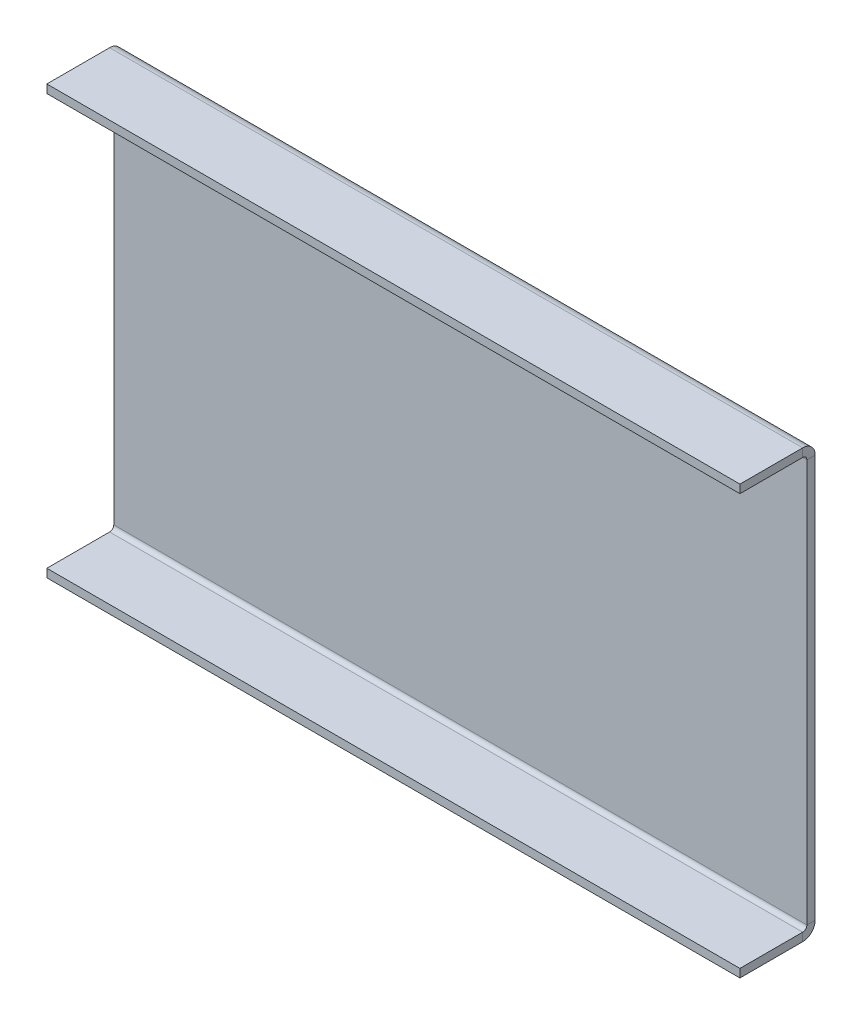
ISO-10303-21;
HEADER;
FILE_DESCRIPTION(('STEP AP214'),'2;1');
FILE_NAME('part.step','',(''),(''),'','','');
FILE_SCHEMA(('AUTOMOTIVE_DESIGN { 1 0 10303 214 1 1 1 1 }'));
ENDSEC;
DATA;
#1=APPLICATION_CONTEXT('core data for automotive mechanical design processes');
#2=APPLICATION_PROTOCOL_DEFINITION('international standard','automotive_design',2000,#1);
#3=PRODUCT_CONTEXT('',#1,'mechanical');
#4=PRODUCT('Part','Part','',(#3));
#5=PRODUCT_RELATED_PRODUCT_CATEGORY('part','',(#4));
#6=PRODUCT_DEFINITION_FORMATION('','',#4);
#7=PRODUCT_DEFINITION_CONTEXT('part definition',#1,'design');
#8=PRODUCT_DEFINITION('design','',#6,#7);
#9=PRODUCT_DEFINITION_SHAPE('','',#8);
#10=(LENGTH_UNIT() NAMED_UNIT(*) SI_UNIT(.MILLI.,.METRE.));
#11=(NAMED_UNIT(*) PLANE_ANGLE_UNIT() SI_UNIT($,.RADIAN.));
#12=(NAMED_UNIT(*) SI_UNIT($,.STERADIAN.) SOLID_ANGLE_UNIT());
#13=UNCERTAINTY_MEASURE_WITH_UNIT(LENGTH_MEASURE(1.E-05),#10,'distance_accuracy_value','');
#14=(GEOMETRIC_REPRESENTATION_CONTEXT(3) GLOBAL_UNCERTAINTY_ASSIGNED_CONTEXT((#13)) GLOBAL_UNIT_ASSIGNED_CONTEXT((#10,
#11,#12)) REPRESENTATION_CONTEXT('',''));
#15=CARTESIAN_POINT('',(0.,0.,0.));
#16=DIRECTION('',(0.,0.,1.));
#17=DIRECTION('',(1.,0.,0.));
#18=AXIS2_PLACEMENT_3D('',#15,#16,#17);
#19=CARTESIAN_POINT('',(-80.,-298.287611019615,54.2876110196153));
#20=DIRECTION('',(0.,0.,-1.));
#21=DIRECTION('',(0.,1.,0.));
#22=AXIS2_PLACEMENT_3D('',#19,#20,#21);
#23=PLANE('',#22);
#24=DIRECTION('',(1.,0.,0.));
#25=VECTOR('',#24,1.);
#26=CARTESIAN_POINT('',(-80.,-304.287611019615,54.2876110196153));
#27=LINE('',#26,#25);
#28=CARTESIAN_POINT('',(-80.,-304.287611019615,54.2876110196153));
#29=VERTEX_POINT('',#28);
#30=CARTESIAN_POINT('',(420.,-304.287611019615,54.2876110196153));
#31=VERTEX_POINT('',#30);
#32=EDGE_CURVE('E63',#29,#31,#27,.T.);
#33=ORIENTED_EDGE('',*,*,#32,.T.);
#34=DIRECTION('',(0.,-1.,0.));
#35=VECTOR('',#34,1.);
#36=CARTESIAN_POINT('',(420.,-298.287611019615,54.2876110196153));
#37=LINE('',#36,#35);
#38=CARTESIAN_POINT('',(420.,-298.287611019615,54.2876110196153));
#39=VERTEX_POINT('',#38);
#40=EDGE_CURVE('E201',#39,#31,#37,.T.);
#41=ORIENTED_EDGE('',*,*,#40,.F.);
#42=DIRECTION('',(1.,0.,0.));
#43=VECTOR('',#42,1.);
#44=CARTESIAN_POINT('',(-80.,-298.287611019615,54.2876110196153));
#45=LINE('',#44,#43);
#46=CARTESIAN_POINT('',(-80.,-298.287611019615,54.2876110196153));
#47=VERTEX_POINT('',#46);
#48=EDGE_CURVE('E11',#47,#39,#45,.T.);
#49=ORIENTED_EDGE('',*,*,#48,.F.);
#50=DIRECTION('',(0.,-1.,0.));
#51=VECTOR('',#50,1.);
#52=CARTESIAN_POINT('',(-80.,-298.287611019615,54.2876110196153));
#53=LINE('',#52,#51);
#54=EDGE_CURVE('E205',#47,#29,#53,.T.);
#55=ORIENTED_EDGE('',*,*,#54,.T.);
#56=EDGE_LOOP('',(#33,#41,#49,#55));
#57=FACE_BOUND('',#56,.T.);
#58=ADVANCED_FACE('F26',(#57),#23,.F.);
#59=CARTESIAN_POINT('',(-80.,-298.287611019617,-345.712388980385));
#60=DIRECTION('',(1.,0.,0.));
#61=DIRECTION('',(0.,0.,-1.));
#62=AXIS2_PLACEMENT_3D('',#59,#60,#61);
#63=PLANE('',#62);
#64=DIRECTION('',(0.,1.,0.));
#65=VECTOR('',#64,1.);
#66=CARTESIAN_POINT('',(-80.,-298.287611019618,9.00000000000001));
#67=LINE('',#66,#65);
#68=CARTESIAN_POINT('',(-80.,-304.287611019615,9.00000000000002));
#69=VERTEX_POINT('',#68);
#70=CARTESIAN_POINT('',(-80.,-298.287611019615,9.00000000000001));
#71=VERTEX_POINT('',#70);
#72=EDGE_CURVE('E30',#69,#71,#67,.T.);
#73=ORIENTED_EDGE('',*,*,#72,.F.);
#74=DIRECTION('',(0.,0.,1.));
#75=VECTOR('',#74,1.);
#76=CARTESIAN_POINT('',(-80.,-304.287611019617,-345.712388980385));
#77=LINE('',#76,#75);
#78=EDGE_CURVE('E203',#69,#29,#77,.T.);
#79=ORIENTED_EDGE('',*,*,#78,.T.);
#80=ORIENTED_EDGE('',*,*,#54,.F.);
#81=DIRECTION('',(0.,0.,1.));
#82=VECTOR('',#81,1.);
#83=CARTESIAN_POINT('',(-80.,-298.287611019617,-345.712388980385));
#84=LINE('',#83,#82);
#85=EDGE_CURVE('E36',#71,#47,#84,.T.);
#86=ORIENTED_EDGE('',*,*,#85,.F.);
#87=EDGE_LOOP('',(#73,#79,#80,#86));
#88=FACE_BOUND('',#87,.T.);
#89=ADVANCED_FACE('F284',(#88),#63,.F.);
#90=CARTESIAN_POINT('',(-80.,-304.287611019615,54.2876110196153));
#91=DIRECTION('',(0.,1.,0.));
#92=DIRECTION('',(1.,0.,0.));
#93=AXIS2_PLACEMENT_3D('',#90,#91,#92);
#94=PLANE('',#93);
#95=DIRECTION('',(-1.,0.,0.));
#96=VECTOR('',#95,1.);
#97=CARTESIAN_POINT('',(-80.,-304.287611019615,8.99999999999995));
#98=LINE('',#97,#96);
#99=CARTESIAN_POINT('',(420.,-304.287611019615,8.99999999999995));
#100=VERTEX_POINT('',#99);
#101=EDGE_CURVE('E208',#100,#69,#98,.T.);
#102=ORIENTED_EDGE('',*,*,#101,.F.);
#103=DIRECTION('',(0.,0.,-1.));
#104=VECTOR('',#103,1.);
#105=CARTESIAN_POINT('',(420.,-304.287611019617,-345.712388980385));
#106=LINE('',#105,#104);
#107=EDGE_CURVE('E199',#31,#100,#106,.T.);
#108=ORIENTED_EDGE('',*,*,#107,.F.);
#109=ORIENTED_EDGE('',*,*,#32,.F.);
#110=ORIENTED_EDGE('',*,*,#78,.F.);
#111=EDGE_LOOP('',(#102,#108,#109,#110));
#112=FACE_BOUND('',#111,.T.);
#113=ADVANCED_FACE('F289',(#112),#94,.F.);
#114=CARTESIAN_POINT('',(420.,-298.287611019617,-345.712388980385));
#115=DIRECTION('',(-1.,0.,0.));
#116=DIRECTION('',(0.,0.,1.));
#117=AXIS2_PLACEMENT_3D('',#114,#115,#116);
#118=PLANE('',#117);
#119=DIRECTION('',(0.,-1.,0.));
#120=VECTOR('',#119,1.);
#121=CARTESIAN_POINT('',(420.,-298.287611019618,9.00000000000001));
#122=LINE('',#121,#120);
#123=CARTESIAN_POINT('',(420.,-298.287611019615,9.00000000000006));
#124=VERTEX_POINT('',#123);
#125=EDGE_CURVE('E71',#124,#100,#122,.T.);
#126=ORIENTED_EDGE('',*,*,#125,.F.);
#127=DIRECTION('',(0.,0.,-1.));
#128=VECTOR('',#127,1.);
#129=CARTESIAN_POINT('',(420.,-298.287611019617,-345.712388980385));
#130=LINE('',#129,#128);
#131=EDGE_CURVE('E197',#39,#124,#130,.T.);
#132=ORIENTED_EDGE('',*,*,#131,.F.);
#133=ORIENTED_EDGE('',*,*,#40,.T.);
#134=ORIENTED_EDGE('',*,*,#107,.T.);
#135=EDGE_LOOP('',(#126,#132,#133,#134));
#136=FACE_BOUND('',#135,.T.);
#137=ADVANCED_FACE('F296',(#136),#118,.F.);
#138=CARTESIAN_POINT('',(-80.,-298.287611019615,54.2876110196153));
#139=DIRECTION('',(0.,1.,0.));
#140=DIRECTION('',(1.,0.,0.));
#141=AXIS2_PLACEMENT_3D('',#138,#139,#140);
#142=PLANE('',#141);
#143=ORIENTED_EDGE('',*,*,#131,.T.);
#144=DIRECTION('',(-1.,0.,0.));
#145=VECTOR('',#144,1.);
#146=CARTESIAN_POINT('',(-80.,-298.287611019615,9.00000000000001));
#147=LINE('',#146,#145);
#148=EDGE_CURVE('E167',#124,#71,#147,.T.);
#149=ORIENTED_EDGE('',*,*,#148,.T.);
#150=ORIENTED_EDGE('',*,*,#85,.T.);
#151=ORIENTED_EDGE('',*,*,#48,.T.);
#152=EDGE_LOOP('',(#143,#149,#150,#151));
#153=FACE_BOUND('',#152,.T.);
#154=ADVANCED_FACE('F28',(#153),#142,.T.);
#155=CARTESIAN_POINT('',(-80.,-1.71238898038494,54.2876110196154));
#156=DIRECTION('',(0.,0.,-1.));
#157=DIRECTION('',(0.,1.,0.));
#158=AXIS2_PLACEMENT_3D('',#155,#156,#157);
#159=PLANE('',#158);
#160=DIRECTION('',(-1.,0.,0.));
#161=VECTOR('',#160,1.);
#162=CARTESIAN_POINT('',(-80.,4.28761101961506,54.2876110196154));
#163=LINE('',#162,#161);
#164=CARTESIAN_POINT('',(420.,4.28761101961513,54.2876110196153));
#165=VERTEX_POINT('',#164);
#166=CARTESIAN_POINT('',(-80.,4.28761101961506,54.2876110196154));
#167=VERTEX_POINT('',#166);
#168=EDGE_CURVE('E99',#165,#167,#163,.T.);
#169=ORIENTED_EDGE('',*,*,#168,.T.);
#170=DIRECTION('',(0.,1.,0.));
#171=VECTOR('',#170,1.);
#172=CARTESIAN_POINT('',(-80.,-1.71238898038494,54.2876110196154));
#173=LINE('',#172,#171);
#174=CARTESIAN_POINT('',(-80.,-1.71238898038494,54.2876110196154));
#175=VERTEX_POINT('',#174);
#176=EDGE_CURVE('E223',#175,#167,#173,.T.);
#177=ORIENTED_EDGE('',*,*,#176,.F.);
#178=DIRECTION('',(-1.,0.,0.));
#179=VECTOR('',#178,1.);
#180=CARTESIAN_POINT('',(-80.,-1.71238898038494,54.2876110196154));
#181=LINE('',#180,#179);
#182=CARTESIAN_POINT('',(420.,-1.71238898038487,54.2876110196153));
#183=VERTEX_POINT('',#182);
#184=EDGE_CURVE('E79',#183,#175,#181,.T.);
#185=ORIENTED_EDGE('',*,*,#184,.F.);
#186=DIRECTION('',(0.,1.,0.));
#187=VECTOR('',#186,1.);
#188=CARTESIAN_POINT('',(420.,-1.71238898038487,54.2876110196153));
#189=LINE('',#188,#187);
#190=EDGE_CURVE('E227',#183,#165,#189,.T.);
#191=ORIENTED_EDGE('',*,*,#190,.T.);
#192=EDGE_LOOP('',(#169,#177,#185,#191));
#193=FACE_BOUND('',#192,.T.);
#194=ADVANCED_FACE('F302',(#193),#159,.F.);
#195=CARTESIAN_POINT('',(420.,-1.71238898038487,54.2876110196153));
#196=DIRECTION('',(-1.,0.,0.));
#197=DIRECTION('',(0.,0.,-1.));
#198=AXIS2_PLACEMENT_3D('',#195,#196,#197);
#199=PLANE('',#198);
#200=DIRECTION('',(0.,-1.,0.));
#201=VECTOR('',#200,1.);
#202=CARTESIAN_POINT('',(420.,-1.7123889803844,9.00000000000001));
#203=LINE('',#202,#201);
#204=CARTESIAN_POINT('',(420.,4.28761101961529,8.99999999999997));
#205=VERTEX_POINT('',#204);
#206=CARTESIAN_POINT('',(420.,-1.71238898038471,8.99999999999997));
#207=VERTEX_POINT('',#206);
#208=EDGE_CURVE('E178',#205,#207,#203,.T.);
#209=ORIENTED_EDGE('',*,*,#208,.F.);
#210=DIRECTION('',(0.,0.,1.));
#211=VECTOR('',#210,1.);
#212=CARTESIAN_POINT('',(420.,4.28761101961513,54.2876110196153));
#213=LINE('',#212,#211);
#214=EDGE_CURVE('E225',#205,#165,#213,.T.);
#215=ORIENTED_EDGE('',*,*,#214,.T.);
#216=ORIENTED_EDGE('',*,*,#190,.F.);
#217=DIRECTION('',(0.,0.,1.));
#218=VECTOR('',#217,1.);
#219=CARTESIAN_POINT('',(420.,-1.71238898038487,54.2876110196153));
#220=LINE('',#219,#218);
#221=EDGE_CURVE('E212',#207,#183,#220,.T.);
#222=ORIENTED_EDGE('',*,*,#221,.F.);
#223=EDGE_LOOP('',(#209,#215,#216,#222));
#224=FACE_BOUND('',#223,.T.);
#225=ADVANCED_FACE('F306',(#224),#199,.F.);
#226=CARTESIAN_POINT('',(-80.,4.28761101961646,-345.712388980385));
#227=DIRECTION('',(0.,-1.,0.));
#228=DIRECTION('',(1.,0.,0.));
#229=AXIS2_PLACEMENT_3D('',#226,#227,#228);
#230=PLANE('',#229);
#231=DIRECTION('',(1.,0.,0.));
#232=VECTOR('',#231,1.);
#233=CARTESIAN_POINT('',(-80.,4.28761101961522,9.00000000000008));
#234=LINE('',#233,#232);
#235=CARTESIAN_POINT('',(-80.,4.28761101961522,9.00000000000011));
#236=VERTEX_POINT('',#235);
#237=EDGE_CURVE('E230',#236,#205,#234,.T.);
#238=ORIENTED_EDGE('',*,*,#237,.F.);
#239=DIRECTION('',(0.,0.,-1.));
#240=VECTOR('',#239,1.);
#241=CARTESIAN_POINT('',(-80.,4.28761101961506,54.2876110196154));
#242=LINE('',#241,#240);
#243=EDGE_CURVE('E221',#167,#236,#242,.T.);
#244=ORIENTED_EDGE('',*,*,#243,.F.);
#245=ORIENTED_EDGE('',*,*,#168,.F.);
#246=ORIENTED_EDGE('',*,*,#214,.F.);
#247=EDGE_LOOP('',(#238,#244,#245,#246));
#248=FACE_BOUND('',#247,.T.);
#249=ADVANCED_FACE('F314',(#248),#230,.F.);
#250=CARTESIAN_POINT('',(-80.,-1.71238898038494,54.2876110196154));
#251=DIRECTION('',(1.,0.,0.));
#252=DIRECTION('',(0.,0.,1.));
#253=AXIS2_PLACEMENT_3D('',#250,#251,#252);
#254=PLANE('',#253);
#255=DIRECTION('',(0.,1.,0.));
#256=VECTOR('',#255,1.);
#257=CARTESIAN_POINT('',(-80.,-1.71238898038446,9.00000000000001));
#258=LINE('',#257,#256);
#259=CARTESIAN_POINT('',(-80.,-1.71238898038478,9.00000000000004));
#260=VERTEX_POINT('',#259);
#261=EDGE_CURVE('E106',#260,#236,#258,.T.);
#262=ORIENTED_EDGE('',*,*,#261,.F.);
#263=DIRECTION('',(0.,0.,-1.));
#264=VECTOR('',#263,1.);
#265=CARTESIAN_POINT('',(-80.,-1.71238898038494,54.2876110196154));
#266=LINE('',#265,#264);
#267=EDGE_CURVE('E219',#175,#260,#266,.T.);
#268=ORIENTED_EDGE('',*,*,#267,.F.);
#269=ORIENTED_EDGE('',*,*,#176,.T.);
#270=ORIENTED_EDGE('',*,*,#243,.T.);
#271=EDGE_LOOP('',(#262,#268,#269,#270));
#272=FACE_BOUND('',#271,.T.);
#273=ADVANCED_FACE('F319',(#272),#254,.F.);
#274=CARTESIAN_POINT('',(-80.,-1.71238898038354,-345.712388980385));
#275=DIRECTION('',(0.,-1.,0.));
#276=DIRECTION('',(1.,0.,0.));
#277=AXIS2_PLACEMENT_3D('',#274,#275,#276);
#278=PLANE('',#277);
#279=ORIENTED_EDGE('',*,*,#267,.T.);
#280=DIRECTION('',(1.,0.,0.));
#281=VECTOR('',#280,1.);
#282=CARTESIAN_POINT('',(-80.,-1.71238898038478,9.00000000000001));
#283=LINE('',#282,#281);
#284=EDGE_CURVE('E214',#260,#207,#283,.T.);
#285=ORIENTED_EDGE('',*,*,#284,.T.);
#286=ORIENTED_EDGE('',*,*,#221,.T.);
#287=ORIENTED_EDGE('',*,*,#184,.T.);
#288=EDGE_LOOP('',(#279,#285,#286,#287));
#289=FACE_BOUND('',#288,.T.);
#290=ADVANCED_FACE('F323',(#289),#278,.T.);
#291=CARTESIAN_POINT('',(-80.,50.,6.));
#292=DIRECTION('',(1.,0.,0.));
#293=DIRECTION('',(0.,1.,0.));
#294=AXIS2_PLACEMENT_3D('',#291,#292,#293);
#295=PLANE('',#294);
#296=DIRECTION('',(0.,-1.,0.));
#297=VECTOR('',#296,1.);
#298=CARTESIAN_POINT('',(-80.,50.,0.));
#299=LINE('',#298,#297);
#300=CARTESIAN_POINT('',(-79.9999999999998,-4.71238898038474,0.));
#301=VERTEX_POINT('',#300);
#302=CARTESIAN_POINT('',(-80.,-295.287611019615,0.));
#303=VERTEX_POINT('',#302);
#304=EDGE_CURVE('E191',#301,#303,#299,.T.);
#305=ORIENTED_EDGE('',*,*,#304,.T.);
#306=DIRECTION('',(0.,0.,1.));
#307=VECTOR('',#306,1.);
#308=CARTESIAN_POINT('',(-80.,-295.287611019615,5.99999999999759));
#309=LINE('',#308,#307);
#310=CARTESIAN_POINT('',(-80.,-295.287611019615,6.));
#311=VERTEX_POINT('',#310);
#312=EDGE_CURVE('E159',#303,#311,#309,.T.);
#313=ORIENTED_EDGE('',*,*,#312,.T.);
#314=DIRECTION('',(0.,-1.,0.));
#315=VECTOR('',#314,1.);
#316=CARTESIAN_POINT('',(-80.,50.,6.));
#317=LINE('',#316,#315);
#318=CARTESIAN_POINT('',(-79.9999999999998,-4.71238898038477,6.));
#319=VERTEX_POINT('',#318);
#320=EDGE_CURVE('E177',#319,#311,#317,.T.);
#321=ORIENTED_EDGE('',*,*,#320,.F.);
#322=DIRECTION('',(0.,0.,-1.));
#323=VECTOR('',#322,1.);
#324=CARTESIAN_POINT('',(-80.,-4.71238898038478,5.99999999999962));
#325=LINE('',#324,#323);
#326=EDGE_CURVE('E255',#319,#301,#325,.T.);
#327=ORIENTED_EDGE('',*,*,#326,.T.);
#328=EDGE_LOOP('',(#305,#313,#321,#327));
#329=FACE_BOUND('',#328,.T.);
#330=ADVANCED_FACE('F261',(#329),#295,.F.);
#331=CARTESIAN_POINT('',(420.,50.,6.));
#332=DIRECTION('',(-1.,0.,0.));
#333=DIRECTION('',(0.,-1.,0.));
#334=AXIS2_PLACEMENT_3D('',#331,#332,#333);
#335=PLANE('',#334);
#336=DIRECTION('',(0.,1.,0.));
#337=VECTOR('',#336,1.);
#338=CARTESIAN_POINT('',(420.,50.,6.));
#339=LINE('',#338,#337);
#340=CARTESIAN_POINT('',(420.,-295.287611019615,5.99999999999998));
#341=VERTEX_POINT('',#340);
#342=CARTESIAN_POINT('',(420.,-4.71238898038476,6.));
#343=VERTEX_POINT('',#342);
#344=EDGE_CURVE('E174',#341,#343,#339,.T.);
#345=ORIENTED_EDGE('',*,*,#344,.F.);
#346=DIRECTION('',(0.,0.,-1.));
#347=VECTOR('',#346,1.);
#348=CARTESIAN_POINT('',(420.,-295.287611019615,5.99999999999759));
#349=LINE('',#348,#347);
#350=CARTESIAN_POINT('',(420.,-295.287611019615,0.));
#351=VERTEX_POINT('',#350);
#352=EDGE_CURVE('E148',#341,#351,#349,.T.);
#353=ORIENTED_EDGE('',*,*,#352,.T.);
#354=DIRECTION('',(0.,1.,0.));
#355=VECTOR('',#354,1.);
#356=CARTESIAN_POINT('',(420.,50.,0.));
#357=LINE('',#356,#355);
#358=CARTESIAN_POINT('',(420.,-4.71238898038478,0.));
#359=VERTEX_POINT('',#358);
#360=EDGE_CURVE('E186',#351,#359,#357,.T.);
#361=ORIENTED_EDGE('',*,*,#360,.T.);
#362=DIRECTION('',(0.,0.,1.));
#363=VECTOR('',#362,1.);
#364=CARTESIAN_POINT('',(420.,-4.71238898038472,5.99999999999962));
#365=LINE('',#364,#363);
#366=EDGE_CURVE('E181',#359,#343,#365,.T.);
#367=ORIENTED_EDGE('',*,*,#366,.T.);
#368=EDGE_LOOP('',(#345,#353,#361,#367));
#369=FACE_BOUND('',#368,.T.);
#370=ADVANCED_FACE('F180',(#369),#335,.F.);
#371=CARTESIAN_POINT('',(-80.,-350.,0.));
#372=DIRECTION('',(0.,0.,1.));
#373=DIRECTION('',(1.,0.,0.));
#374=AXIS2_PLACEMENT_3D('',#371,#372,#373);
#375=PLANE('',#374);
#376=ORIENTED_EDGE('',*,*,#360,.F.);
#377=DIRECTION('',(-1.,0.,0.));
#378=VECTOR('',#377,1.);
#379=CARTESIAN_POINT('',(-80.,-295.287611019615,0.));
#380=LINE('',#379,#378);
#381=EDGE_CURVE('E160',#351,#303,#380,.T.);
#382=ORIENTED_EDGE('',*,*,#381,.T.);
#383=ORIENTED_EDGE('',*,*,#304,.F.);
#384=DIRECTION('',(1.,0.,0.));
#385=VECTOR('',#384,1.);
#386=CARTESIAN_POINT('',(-80.,-4.71238898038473,0.));
#387=LINE('',#386,#385);
#388=EDGE_CURVE('E182',#301,#359,#387,.T.);
#389=ORIENTED_EDGE('',*,*,#388,.T.);
#390=EDGE_LOOP('',(#376,#382,#383,#389));
#391=FACE_BOUND('',#390,.T.);
#392=ADVANCED_FACE('F268',(#391),#375,.F.);
#393=CARTESIAN_POINT('',(-80.,-350.,6.));
#394=DIRECTION('',(0.,0.,1.));
#395=DIRECTION('',(1.,0.,0.));
#396=AXIS2_PLACEMENT_3D('',#393,#394,#395);
#397=PLANE('',#396);
#398=DIRECTION('',(-1.,0.,0.));
#399=VECTOR('',#398,1.);
#400=CARTESIAN_POINT('',(-80.,-295.287611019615,6.));
#401=LINE('',#400,#399);
#402=EDGE_CURVE('E165',#341,#311,#401,.T.);
#403=ORIENTED_EDGE('',*,*,#402,.F.);
#404=ORIENTED_EDGE('',*,*,#344,.T.);
#405=DIRECTION('',(1.,0.,0.));
#406=VECTOR('',#405,1.);
#407=CARTESIAN_POINT('',(-80.,-4.71238898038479,6.));
#408=LINE('',#407,#406);
#409=EDGE_CURVE('E243',#319,#343,#408,.T.);
#410=ORIENTED_EDGE('',*,*,#409,.F.);
#411=ORIENTED_EDGE('',*,*,#320,.T.);
#412=EDGE_LOOP('',(#403,#404,#410,#411));
#413=FACE_BOUND('',#412,.T.);
#414=ADVANCED_FACE('F172',(#413),#397,.T.);
#415=CARTESIAN_POINT('',(420.,-4.71238898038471,9.));
#416=DIRECTION('',(-1.,0.,0.));
#417=DIRECTION('',(0.,0.,1.));
#418=AXIS2_PLACEMENT_3D('',#415,#416,#417);
#419=PLANE('',#418);
#420=ORIENTED_EDGE('',*,*,#208,.T.);
#421=CARTESIAN_POINT('',(420.,-4.71238898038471,9.));
#422=DIRECTION('',(-1.,0.,0.));
#423=DIRECTION('',(0.,-1.,0.));
#424=AXIS2_PLACEMENT_3D('',#421,#422,#423);
#425=CIRCLE('',#424,3.);
#426=EDGE_CURVE('E121',#343,#207,#425,.F.);
#427=ORIENTED_EDGE('',*,*,#426,.F.);
#428=ORIENTED_EDGE('',*,*,#366,.F.);
#429=CARTESIAN_POINT('',(420.,-4.71238898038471,9.));
#430=DIRECTION('',(-1.,0.,0.));
#431=DIRECTION('',(0.,-1.,0.));
#432=AXIS2_PLACEMENT_3D('',#429,#430,#431);
#433=CIRCLE('',#432,9.);
#434=EDGE_CURVE('E193',#359,#205,#433,.F.);
#435=ORIENTED_EDGE('',*,*,#434,.T.);
#436=EDGE_LOOP('',(#420,#427,#428,#435));
#437=FACE_BOUND('',#436,.T.);
#438=ADVANCED_FACE('F235',(#437),#419,.F.);
#439=CARTESIAN_POINT('',(-79.9999999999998,-4.71238898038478,9.));
#440=DIRECTION('',(1.,0.,0.));
#441=DIRECTION('',(0.,0.,-1.));
#442=AXIS2_PLACEMENT_3D('',#439,#440,#441);
#443=PLANE('',#442);
#444=ORIENTED_EDGE('',*,*,#326,.F.);
#445=CARTESIAN_POINT('',(-79.9999999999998,-4.71238898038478,9.));
#446=DIRECTION('',(-1.,0.,0.));
#447=DIRECTION('',(0.,-1.,0.));
#448=AXIS2_PLACEMENT_3D('',#445,#446,#447);
#449=CIRCLE('',#448,3.);
#450=EDGE_CURVE('E245',#260,#319,#449,.T.);
#451=ORIENTED_EDGE('',*,*,#450,.F.);
#452=ORIENTED_EDGE('',*,*,#261,.T.);
#453=CARTESIAN_POINT('',(-79.9999999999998,-4.71238898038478,9.));
#454=DIRECTION('',(-1.,0.,0.));
#455=DIRECTION('',(0.,-1.,0.));
#456=AXIS2_PLACEMENT_3D('',#453,#454,#455);
#457=CIRCLE('',#456,9.);
#458=EDGE_CURVE('E244',#236,#301,#457,.T.);
#459=ORIENTED_EDGE('',*,*,#458,.T.);
#460=EDGE_LOOP('',(#444,#451,#452,#459));
#461=FACE_BOUND('',#460,.T.);
#462=ADVANCED_FACE('F273',(#461),#443,.F.);
#463=CARTESIAN_POINT('',(1251.77457848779,-4.71238898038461,9.));
#464=DIRECTION('',(-1.,0.,0.));
#465=DIRECTION('',(0.,-1.,0.));
#466=AXIS2_PLACEMENT_3D('',#463,#464,#465);
#467=CYLINDRICAL_SURFACE('',#466,9.);
#468=ORIENTED_EDGE('',*,*,#458,.F.);
#469=ORIENTED_EDGE('',*,*,#237,.T.);
#470=ORIENTED_EDGE('',*,*,#434,.F.);
#471=ORIENTED_EDGE('',*,*,#388,.F.);
#472=EDGE_LOOP('',(#468,#469,#470,#471));
#473=FACE_BOUND('',#472,.T.);
#474=ADVANCED_FACE('F271',(#473),#467,.T.);
#475=CARTESIAN_POINT('',(1251.77457848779,-4.71238898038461,9.));
#476=DIRECTION('',(-1.,0.,0.));
#477=DIRECTION('',(0.,-1.,0.));
#478=AXIS2_PLACEMENT_3D('',#475,#476,#477);
#479=CYLINDRICAL_SURFACE('',#478,3.);
#480=ORIENTED_EDGE('',*,*,#450,.T.);
#481=ORIENTED_EDGE('',*,*,#409,.T.);
#482=ORIENTED_EDGE('',*,*,#426,.T.);
#483=ORIENTED_EDGE('',*,*,#284,.F.);
#484=EDGE_LOOP('',(#480,#481,#482,#483));
#485=FACE_BOUND('',#484,.T.);
#486=ADVANCED_FACE('F242',(#485),#479,.F.);
#487=CARTESIAN_POINT('',(-80.,-295.287611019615,9.));
#488=DIRECTION('',(1.,0.,0.));
#489=DIRECTION('',(0.,0.,-1.));
#490=AXIS2_PLACEMENT_3D('',#487,#488,#489);
#491=PLANE('',#490);
#492=ORIENTED_EDGE('',*,*,#72,.T.);
#493=CARTESIAN_POINT('',(-80.,-295.287611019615,9.));
#494=DIRECTION('',(1.,0.,0.));
#495=DIRECTION('',(0.,1.,0.));
#496=AXIS2_PLACEMENT_3D('',#493,#494,#495);
#497=CIRCLE('',#496,3.00000000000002);
#498=EDGE_CURVE('E113',#311,#71,#497,.F.);
#499=ORIENTED_EDGE('',*,*,#498,.F.);
#500=ORIENTED_EDGE('',*,*,#312,.F.);
#501=CARTESIAN_POINT('',(-80.,-295.287611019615,9.));
#502=DIRECTION('',(1.,0.,0.));
#503=DIRECTION('',(0.,1.,0.));
#504=AXIS2_PLACEMENT_3D('',#501,#502,#503);
#505=CIRCLE('',#504,9.00000000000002);
#506=EDGE_CURVE('E249',#303,#69,#505,.F.);
#507=ORIENTED_EDGE('',*,*,#506,.T.);
#508=EDGE_LOOP('',(#492,#499,#500,#507));
#509=FACE_BOUND('',#508,.T.);
#510=ADVANCED_FACE('F264',(#509),#491,.F.);
#511=CARTESIAN_POINT('',(420.,-295.287611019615,9.));
#512=DIRECTION('',(-1.,0.,0.));
#513=DIRECTION('',(0.,0.,1.));
#514=AXIS2_PLACEMENT_3D('',#511,#512,#513);
#515=PLANE('',#514);
#516=ORIENTED_EDGE('',*,*,#352,.F.);
#517=CARTESIAN_POINT('',(420.,-295.287611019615,9.));
#518=DIRECTION('',(1.,0.,0.));
#519=DIRECTION('',(0.,1.,0.));
#520=AXIS2_PLACEMENT_3D('',#517,#518,#519);
#521=CIRCLE('',#520,3.00000000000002);
#522=EDGE_CURVE('E151',#124,#341,#521,.T.);
#523=ORIENTED_EDGE('',*,*,#522,.F.);
#524=ORIENTED_EDGE('',*,*,#125,.T.);
#525=CARTESIAN_POINT('',(420.,-295.287611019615,9.));
#526=DIRECTION('',(1.,0.,0.));
#527=DIRECTION('',(0.,1.,0.));
#528=AXIS2_PLACEMENT_3D('',#525,#526,#527);
#529=CIRCLE('',#528,9.00000000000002);
#530=EDGE_CURVE('E154',#100,#351,#529,.T.);
#531=ORIENTED_EDGE('',*,*,#530,.T.);
#532=EDGE_LOOP('',(#516,#523,#524,#531));
#533=FACE_BOUND('',#532,.T.);
#534=ADVANCED_FACE('F150',(#533),#515,.F.);
#535=CARTESIAN_POINT('',(-820.338218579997,-295.287611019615,9.));
#536=DIRECTION('',(1.,0.,0.));
#537=DIRECTION('',(0.,1.,0.));
#538=AXIS2_PLACEMENT_3D('',#535,#536,#537);
#539=CYLINDRICAL_SURFACE('',#538,9.00000000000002);
#540=ORIENTED_EDGE('',*,*,#530,.F.);
#541=ORIENTED_EDGE('',*,*,#101,.T.);
#542=ORIENTED_EDGE('',*,*,#506,.F.);
#543=ORIENTED_EDGE('',*,*,#381,.F.);
#544=EDGE_LOOP('',(#540,#541,#542,#543));
#545=FACE_BOUND('',#544,.T.);
#546=ADVANCED_FACE('F266',(#545),#539,.T.);
#547=CARTESIAN_POINT('',(-820.338218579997,-295.287611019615,9.));
#548=DIRECTION('',(1.,0.,0.));
#549=DIRECTION('',(0.,1.,0.));
#550=AXIS2_PLACEMENT_3D('',#547,#548,#549);
#551=CYLINDRICAL_SURFACE('',#550,3.00000000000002);
#552=ORIENTED_EDGE('',*,*,#522,.T.);
#553=ORIENTED_EDGE('',*,*,#402,.T.);
#554=ORIENTED_EDGE('',*,*,#498,.T.);
#555=ORIENTED_EDGE('',*,*,#148,.F.);
#556=EDGE_LOOP('',(#552,#553,#554,#555));
#557=FACE_BOUND('',#556,.T.);
#558=ADVANCED_FACE('F164',(#557),#551,.F.);
#559=CLOSED_SHELL('',(#58,#89,#113,#137,#154,#194,#225,#249,#273,#290,#330,#370,#392,#414,#438,
#462,#474,#486,#510,#534,#546,#558));
#560=MANIFOLD_SOLID_BREP('B2',#559);
#561=ADVANCED_BREP_SHAPE_REPRESENTATION('',(#18,#560),#14);
#562=SHAPE_DEFINITION_REPRESENTATION(#9,#561);
ENDSEC;
END-ISO-10303-21;
